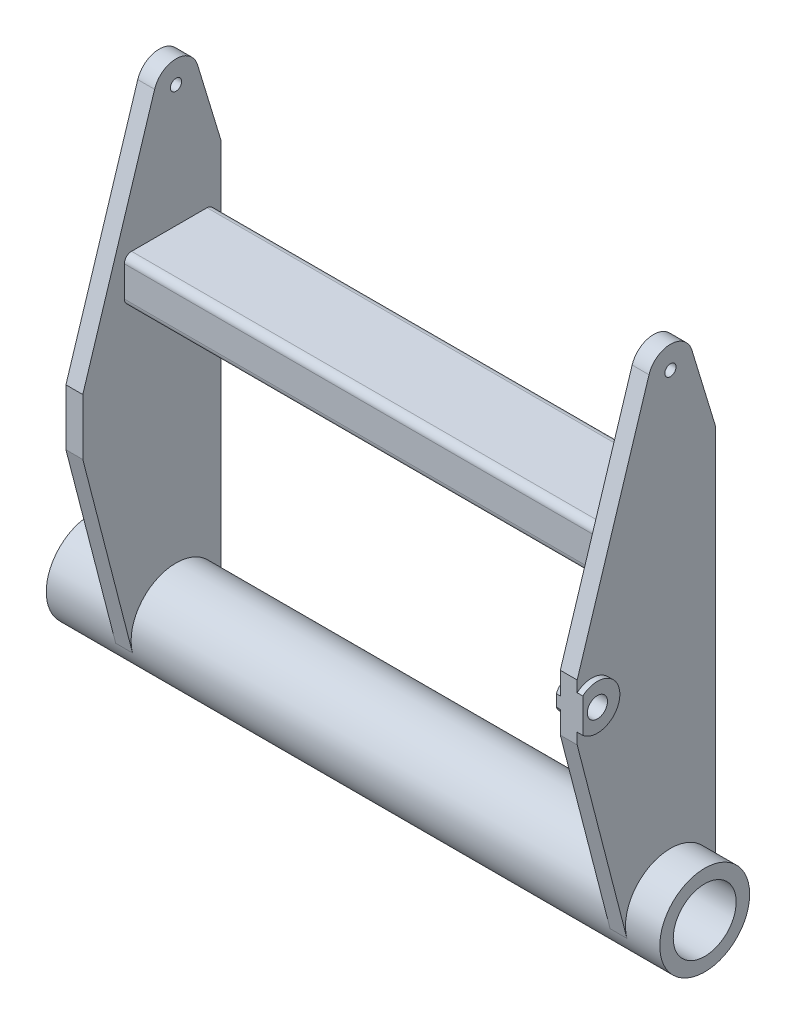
from build123d import *

# Parameters (mm, degrees)
ESQUISSE1_R             = 9
EXTRUSION1_DEPTH        = 15
EXTRUSION2_DEPTH        = 425
EXTRUSION3_DEPTH        = 30.5
EXTRUSION3_DEPTH_BACK   = 515.5
ESQUISSE3_R             = 40
ESQUISSE3_R_2           = 28
EXTRUSION5_START        = 15
EXTRUSION5_DEPTH        = 15
ESQUISSE6_R             = 9
EXTRUSION7_DEPTH        = 5
EXTRUSION8_START        = 3.5
ESQUISSE7_R             = 9
EXTRUSION8_DEPTH        = 3.5
ESQUISSE8_R             = 5
ENL_V_MAT_EXTRU_1_DEPTH = 676.519955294


with BuildPart() as part:
    # Esquisse1 → Extrusion1 (new body)
    with BuildSketch(Plane(origin=(212.5, 0, 0), x_dir=(0, 0, -1), z_dir=(1, 0, 0))):
        with BuildLine():
            Line((40, 0), (40, 345.743428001))
            Line((40, 345.743428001), (19.136271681, 414.414043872))
            ThreePointArc((19.136271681, 414.414043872), (0.096707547, 428.59976619), (-19.079151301, 414.598832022))
            Line((-19.079151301, 414.598832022), (-83, 211.3))
            Line((-83, 211.3), (-83, 161.3))
            Line((-83, 161.3), (-38.727605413, -10.008625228))
            ThreePointArc((-38.727605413, -10.008625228), (-5.044590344, 39.680626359), (40, 0))
        make_face()
        with Locations((-70, 186.3)):
            Circle(ESQUISSE1_R, mode=Mode.SUBTRACT)
    extrude(amount=EXTRUSION1_DEPTH)

    # Esquisse2 → Extrusion2 (add)
    with BuildSketch(Plane.ZY.offset(-212.5)):
        with BuildLine():
            Line((-34, 293.6), (-34, 266.4))
            ThreePointArc((-34, 266.4), (-32.1254834, 261.8745166), (-27.6, 260))
            Line((-27.6, 260), (39.6, 260))
            ThreePointArc((39.6, 260), (44.1254834, 261.8745166), (46, 266.4))
            Line((46, 266.4), (46, 293.6))
            ThreePointArc((46, 293.6), (44.1254834, 298.1254834), (39.6, 300))
            Line((39.6, 300), (-27.6, 300))
            ThreePointArc((-27.6, 300), (-32.1254834, 298.1254834), (-34, 293.6))
        make_face()
        with BuildLine():
            Line((-27.6, 296.8), (39.6, 296.8))
            ThreePointArc((39.6, 296.8), (41.8627417, 295.8627417), (42.8, 293.6))
            Line((42.8, 293.6), (42.8, 266.4))
            ThreePointArc((42.8, 266.4), (41.8627417, 264.1372583), (39.6, 263.2))
            Line((39.6, 263.2), (-27.6, 263.2))
            ThreePointArc((-27.6, 263.2), (-29.8627417, 264.1372583), (-30.8, 266.4))
            Line((-30.8, 266.4), (-30.8, 293.6))
            ThreePointArc((-30.8, 293.6), (-29.8627417, 295.8627417), (-27.6, 296.8))
        make_face(mode=Mode.SUBTRACT)
    extrude(amount=EXTRUSION2_DEPTH)

    # Esquisse3 → Extrusion3 (add, two sides: drawn at the far end of the back side and taken through both)
    with BuildSketch(Plane(origin=(227.5, 0, 0), x_dir=(0, 0, -1), z_dir=(1, 0, 0)).offset(-EXTRUSION3_DEPTH_BACK)):
        Circle(ESQUISSE3_R)
        with Locations(Location((0, 0, 0), (0, 0, 180))):
            Circle(ESQUISSE3_R_2, mode=Mode.SUBTRACT)
    extrude(amount=EXTRUSION3_DEPTH + EXTRUSION3_DEPTH_BACK)

    # Esquisse5 → Extrusion5 (add)
    with BuildSketch(Plane.ZY.offset(212.5).offset(EXTRUSION5_START)):
        with BuildLine():
            Line((38.727605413, -10.008625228), (83, 161.3))
            Line((83, 161.3), (83, 211.3))
            Line((83, 211.3), (19.079151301, 414.598832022))
            ThreePointArc((19.079151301, 414.598832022), (-0.096707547, 428.59976619), (-19.136271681, 414.414043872))
            Line((-19.136271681, 414.414043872), (-40, 345.743428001))
            Line((-40, 345.743428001), (-40, 0))
            ThreePointArc((-40, 0), (5.044590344, 39.680626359), (38.727605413, -10.008625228))
        make_face()
    extrude(amount=-EXTRUSION5_DEPTH)

    # Esquisse6 → Extrusion7 (add)
    with BuildSketch(Plane(origin=(227.5, 0, 0), x_dir=(0, 0, -1), z_dir=(1, 0, 0))):
        with BuildLine():
            Line((-83, 201.498684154), (-83, 171.101315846))
            ThreePointArc((-83, 171.101315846), (-50, 186.3), (-83, 201.498684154))
        make_face()
        with Locations((-70, 186.3)):
            Circle(ESQUISSE6_R, mode=Mode.SUBTRACT)
    extrude(amount=EXTRUSION7_DEPTH)

    # Esquisse7 → Extrusion8 (add)
    with BuildSketch(Plane.ZY.offset(-212.5).offset(EXTRUSION8_START)):
        with BuildLine():
            Line((83, 191.496152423), (83, 181.103847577))
            ThreePointArc((83, 181.103847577), (56, 186.3), (83, 191.496152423))
        make_face()
        with Locations((70, 186.3)):
            Circle(ESQUISSE7_R, mode=Mode.SUBTRACT)
    extrude(amount=-EXTRUSION8_DEPTH)

    # Esquisse8 → Enl_v. mat.-Extru.1 (cut, through all)
    with BuildSketch(Plane(origin=(227.5, 0, 0), x_dir=(0, 0, -1), z_dir=(1, 0, 0))):
        with Locations(Location((0, 408.6, 0), (0, 0, 180))):
            Circle(ESQUISSE8_R)
    extrude(amount=-ENL_V_MAT_EXTRU_1_DEPTH, mode=Mode.SUBTRACT)


solid = part.part
